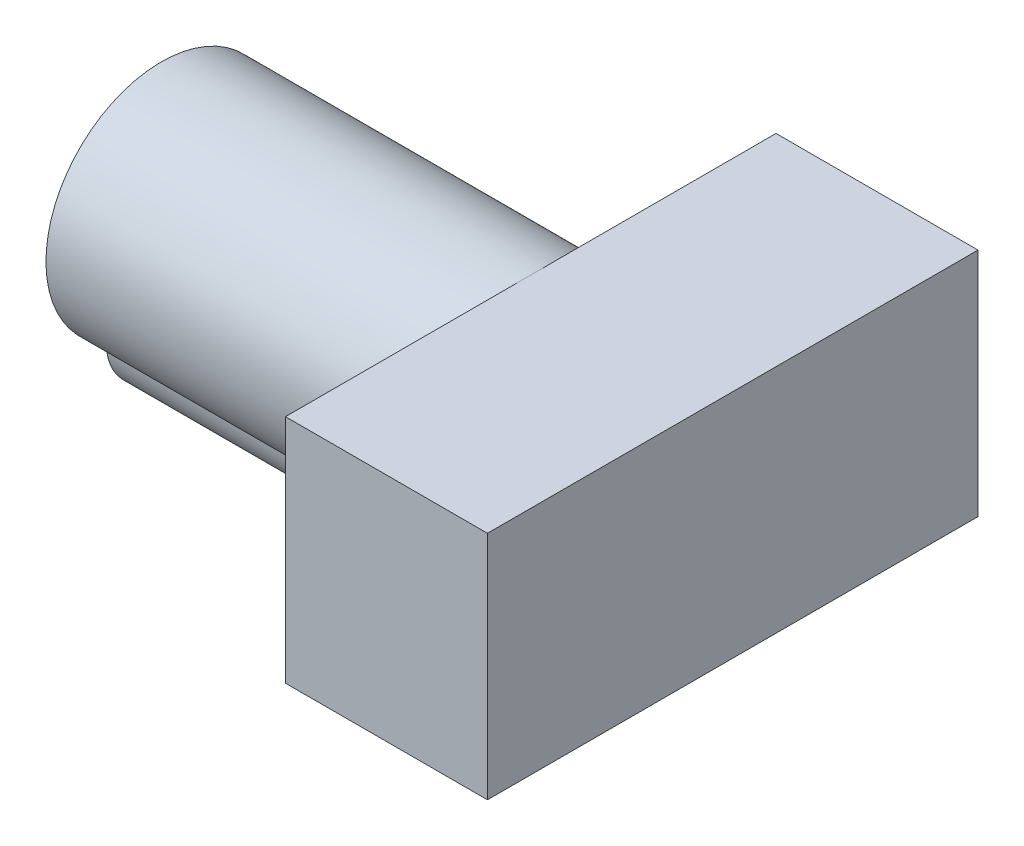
ISO-10303-21;
HEADER;
FILE_DESCRIPTION(('STEP AP214'),'2;1');
FILE_NAME('part.step','',(''),(''),'','','');
FILE_SCHEMA(('AUTOMOTIVE_DESIGN { 1 0 10303 214 1 1 1 1 }'));
ENDSEC;
DATA;
#1=APPLICATION_CONTEXT('core data for automotive mechanical design processes');
#2=APPLICATION_PROTOCOL_DEFINITION('international standard','automotive_design',2000,#1);
#3=PRODUCT_CONTEXT('',#1,'mechanical');
#4=PRODUCT('Part','Part','',(#3));
#5=PRODUCT_RELATED_PRODUCT_CATEGORY('part','',(#4));
#6=PRODUCT_DEFINITION_FORMATION('','',#4);
#7=PRODUCT_DEFINITION_CONTEXT('part definition',#1,'design');
#8=PRODUCT_DEFINITION('design','',#6,#7);
#9=PRODUCT_DEFINITION_SHAPE('','',#8);
#10=(LENGTH_UNIT() NAMED_UNIT(*) SI_UNIT(.MILLI.,.METRE.));
#11=(NAMED_UNIT(*) PLANE_ANGLE_UNIT() SI_UNIT($,.RADIAN.));
#12=(NAMED_UNIT(*) SI_UNIT($,.STERADIAN.) SOLID_ANGLE_UNIT());
#13=UNCERTAINTY_MEASURE_WITH_UNIT(LENGTH_MEASURE(1.E-05),#10,'distance_accuracy_value','');
#14=(GEOMETRIC_REPRESENTATION_CONTEXT(3) GLOBAL_UNCERTAINTY_ASSIGNED_CONTEXT((#13)) GLOBAL_UNIT_ASSIGNED_CONTEXT((#10,
#11,#12)) REPRESENTATION_CONTEXT('',''));
#15=CARTESIAN_POINT('',(0.,0.,0.));
#16=DIRECTION('',(0.,0.,1.));
#17=DIRECTION('',(1.,0.,0.));
#18=AXIS2_PLACEMENT_3D('',#15,#16,#17);
#19=CARTESIAN_POINT('',(-81.28,25.4,-53.975));
#20=DIRECTION('',(-1.,0.,0.));
#21=DIRECTION('',(0.,0.,1.));
#22=AXIS2_PLACEMENT_3D('',#19,#20,#21);
#23=PLANE('',#22);
#24=DIRECTION('',(0.,-1.,0.));
#25=VECTOR('',#24,1.);
#26=CARTESIAN_POINT('',(-81.28,12.7,-67.2214926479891));
#27=LINE('',#26,#25);
#28=CARTESIAN_POINT('',(-81.28,3.72765742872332,-67.2214926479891));
#29=VERTEX_POINT('',#28);
#30=CARTESIAN_POINT('',(-81.28,3.09636220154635,-67.2214926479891));
#31=VERTEX_POINT('',#30);
#32=EDGE_CURVE('E53',#29,#31,#27,.T.);
#33=ORIENTED_EDGE('',*,*,#32,.T.);
#34=CARTESIAN_POINT('',(-81.28,3.41200981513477,-54.5214926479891));
#35=DIRECTION('',(-1.,0.,0.));
#36=DIRECTION('',(0.,0.,1.));
#37=AXIS2_PLACEMENT_3D('',#34,#35,#36);
#38=CIRCLE('',#37,12.7039219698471);
#39=CARTESIAN_POINT('',(-81.28,3.09636220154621,-41.8214926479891));
#40=VERTEX_POINT('',#39);
#41=EDGE_CURVE('E94',#31,#40,#38,.T.);
#42=ORIENTED_EDGE('',*,*,#41,.T.);
#43=CARTESIAN_POINT('',(-81.28,25.4,-53.975));
#44=DIRECTION('',(-1.,0.,0.));
#45=DIRECTION('',(0.,0.,1.));
#46=AXIS2_PLACEMENT_3D('',#43,#44,#45);
#47=CIRCLE('',#46,25.4);
#48=EDGE_CURVE('E107',#40,#29,#47,.T.);
#49=ORIENTED_EDGE('',*,*,#48,.T.);
#50=EDGE_LOOP('',(#33,#42,#49));
#51=FACE_BOUND('',#50,.T.);
#52=ADVANCED_FACE('F32',(#51),#23,.T.);
#53=CARTESIAN_POINT('',(-81.28,12.7,-67.2214926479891));
#54=DIRECTION('',(0.,0.,-1.));
#55=DIRECTION('',(-1.,0.,0.));
#56=AXIS2_PLACEMENT_3D('',#53,#54,#55);
#57=PLANE('',#56);
#58=DIRECTION('',(0.,-1.,0.));
#59=VECTOR('',#58,1.);
#60=CARTESIAN_POINT('',(-30.48,12.7,-67.2214926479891));
#61=LINE('',#60,#59);
#62=CARTESIAN_POINT('',(-30.48,3.72765742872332,-67.2214926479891));
#63=VERTEX_POINT('',#62);
#64=CARTESIAN_POINT('',(-30.48,3.09636220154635,-67.2214926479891));
#65=VERTEX_POINT('',#64);
#66=EDGE_CURVE('E105',#63,#65,#61,.T.);
#67=ORIENTED_EDGE('',*,*,#66,.T.);
#68=DIRECTION('',(-1.,0.,0.));
#69=VECTOR('',#68,1.);
#70=CARTESIAN_POINT('',(-25.4,3.09636220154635,-67.2214926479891));
#71=LINE('',#70,#69);
#72=EDGE_CURVE('E47',#65,#31,#71,.T.);
#73=ORIENTED_EDGE('',*,*,#72,.T.);
#74=ORIENTED_EDGE('',*,*,#32,.F.);
#75=DIRECTION('',(1.,0.,0.));
#76=VECTOR('',#75,1.);
#77=CARTESIAN_POINT('',(-81.28,3.72765742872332,-67.2214926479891));
#78=LINE('',#77,#76);
#79=EDGE_CURVE('E109',#63,#29,#78,.F.);
#80=ORIENTED_EDGE('',*,*,#79,.F.);
#81=EDGE_LOOP('',(#67,#73,#74,#80));
#82=FACE_BOUND('',#81,.T.);
#83=ADVANCED_FACE('F103',(#82),#57,.T.);
#84=CARTESIAN_POINT('',(-30.48,12.7,-67.2214926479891));
#85=DIRECTION('',(1.,0.,0.));
#86=DIRECTION('',(0.,0.,-1.));
#87=AXIS2_PLACEMENT_3D('',#84,#85,#86);
#88=PLANE('',#87);
#89=CARTESIAN_POINT('',(-30.48,25.4,-53.975));
#90=DIRECTION('',(1.,0.,0.));
#91=DIRECTION('',(0.,0.,-1.));
#92=AXIS2_PLACEMENT_3D('',#89,#90,#91);
#93=CIRCLE('',#92,25.4);
#94=CARTESIAN_POINT('',(-30.48,3.09636220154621,-41.8214926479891));
#95=VERTEX_POINT('',#94);
#96=EDGE_CURVE('E40',#95,#63,#93,.T.);
#97=ORIENTED_EDGE('',*,*,#96,.F.);
#98=CARTESIAN_POINT('',(-30.48,3.41200981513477,-54.5214926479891));
#99=DIRECTION('',(1.,0.,0.));
#100=DIRECTION('',(0.,0.,-1.));
#101=AXIS2_PLACEMENT_3D('',#98,#99,#100);
#102=CIRCLE('',#101,12.7039219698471);
#103=EDGE_CURVE('E11',#95,#65,#102,.T.);
#104=ORIENTED_EDGE('',*,*,#103,.T.);
#105=ORIENTED_EDGE('',*,*,#66,.F.);
#106=EDGE_LOOP('',(#97,#104,#105));
#107=FACE_BOUND('',#106,.T.);
#108=ADVANCED_FACE('F197',(#107),#88,.T.);
#109=CARTESIAN_POINT('',(0.,50.8,0.));
#110=DIRECTION('',(1.,0.,0.));
#111=DIRECTION('',(0.,0.,-1.));
#112=AXIS2_PLACEMENT_3D('',#109,#110,#111);
#113=PLANE('',#112);
#114=CARTESIAN_POINT('',(0.,25.4,-53.975));
#115=DIRECTION('',(-1.,0.,0.));
#116=DIRECTION('',(0.,0.,1.));
#117=AXIS2_PLACEMENT_3D('',#114,#115,#116);
#118=CIRCLE('',#117,25.4);
#119=CARTESIAN_POINT('',(0.,50.8,-53.975));
#120=VERTEX_POINT('',#119);
#121=CARTESIAN_POINT('',(0.,0.,-53.975));
#122=VERTEX_POINT('',#121);
#123=EDGE_CURVE('E114',#120,#122,#118,.T.);
#124=ORIENTED_EDGE('',*,*,#123,.F.);
#125=DIRECTION('',(0.,0.,1.));
#126=VECTOR('',#125,1.);
#127=CARTESIAN_POINT('',(0.,50.8,0.));
#128=LINE('',#127,#126);
#129=CARTESIAN_POINT('',(0.,50.8,-107.95));
#130=VERTEX_POINT('',#129);
#131=EDGE_CURVE('E120',#130,#120,#128,.T.);
#132=ORIENTED_EDGE('',*,*,#131,.F.);
#133=DIRECTION('',(0.,-1.,0.));
#134=VECTOR('',#133,1.);
#135=CARTESIAN_POINT('',(0.,50.8,-107.95));
#136=LINE('',#135,#134);
#137=CARTESIAN_POINT('',(0.,0.,-107.95));
#138=VERTEX_POINT('',#137);
#139=EDGE_CURVE('E129',#130,#138,#136,.T.);
#140=ORIENTED_EDGE('',*,*,#139,.T.);
#141=DIRECTION('',(0.,0.,1.));
#142=VECTOR('',#141,1.);
#143=CARTESIAN_POINT('',(0.,0.,0.));
#144=LINE('',#143,#142);
#145=EDGE_CURVE('E130',#138,#122,#144,.T.);
#146=ORIENTED_EDGE('',*,*,#145,.T.);
#147=EDGE_LOOP('',(#124,#132,#140,#146));
#148=FACE_BOUND('',#147,.T.);
#149=ADVANCED_FACE('F167',(#148),#113,.F.);
#150=EDGE_CURVE('E119',#122,#120,#118,.T.);
#151=ORIENTED_EDGE('',*,*,#150,.F.);
#152=CARTESIAN_POINT('',(0.,0.,0.));
#153=VERTEX_POINT('',#152);
#154=EDGE_CURVE('E116',#122,#153,#144,.T.);
#155=ORIENTED_EDGE('',*,*,#154,.T.);
#156=DIRECTION('',(0.,-1.,0.));
#157=VECTOR('',#156,1.);
#158=CARTESIAN_POINT('',(0.,50.8,0.));
#159=LINE('',#158,#157);
#160=CARTESIAN_POINT('',(0.,50.8,0.));
#161=VERTEX_POINT('',#160);
#162=EDGE_CURVE('E147',#161,#153,#159,.T.);
#163=ORIENTED_EDGE('',*,*,#162,.F.);
#164=EDGE_CURVE('E123',#120,#161,#128,.T.);
#165=ORIENTED_EDGE('',*,*,#164,.F.);
#166=EDGE_LOOP('',(#151,#155,#163,#165));
#167=FACE_BOUND('',#166,.T.);
#168=ADVANCED_FACE('F34',(#167),#113,.F.);
#169=CARTESIAN_POINT('',(0.,50.8,0.));
#170=DIRECTION('',(0.,0.,-1.));
#171=DIRECTION('',(-1.,0.,0.));
#172=AXIS2_PLACEMENT_3D('',#169,#170,#171);
#173=PLANE('',#172);
#174=DIRECTION('',(1.,0.,0.));
#175=VECTOR('',#174,1.);
#176=CARTESIAN_POINT('',(0.,0.,0.));
#177=LINE('',#176,#175);
#178=CARTESIAN_POINT('',(44.45,0.,0.));
#179=VERTEX_POINT('',#178);
#180=EDGE_CURVE('E133',#153,#179,#177,.T.);
#181=ORIENTED_EDGE('',*,*,#180,.T.);
#182=DIRECTION('',(0.,-1.,0.));
#183=VECTOR('',#182,1.);
#184=CARTESIAN_POINT('',(44.45,50.8,0.));
#185=LINE('',#184,#183);
#186=CARTESIAN_POINT('',(44.45,50.8,0.));
#187=VERTEX_POINT('',#186);
#188=EDGE_CURVE('E144',#187,#179,#185,.T.);
#189=ORIENTED_EDGE('',*,*,#188,.F.);
#190=DIRECTION('',(1.,0.,0.));
#191=VECTOR('',#190,1.);
#192=CARTESIAN_POINT('',(0.,50.8,0.));
#193=LINE('',#192,#191);
#194=EDGE_CURVE('E122',#161,#187,#193,.T.);
#195=ORIENTED_EDGE('',*,*,#194,.F.);
#196=ORIENTED_EDGE('',*,*,#162,.T.);
#197=EDGE_LOOP('',(#181,#189,#195,#196));
#198=FACE_BOUND('',#197,.T.);
#199=ADVANCED_FACE('F180',(#198),#173,.F.);
#200=CARTESIAN_POINT('',(44.45,50.8,0.));
#201=DIRECTION('',(-1.,0.,0.));
#202=DIRECTION('',(0.,0.,1.));
#203=AXIS2_PLACEMENT_3D('',#200,#201,#202);
#204=PLANE('',#203);
#205=DIRECTION('',(0.,0.,-1.));
#206=VECTOR('',#205,1.);
#207=CARTESIAN_POINT('',(44.45,0.,0.));
#208=LINE('',#207,#206);
#209=CARTESIAN_POINT('',(44.45,0.,-107.95));
#210=VERTEX_POINT('',#209);
#211=EDGE_CURVE('E135',#179,#210,#208,.T.);
#212=ORIENTED_EDGE('',*,*,#211,.T.);
#213=DIRECTION('',(0.,-1.,0.));
#214=VECTOR('',#213,1.);
#215=CARTESIAN_POINT('',(44.45,50.8,-107.95));
#216=LINE('',#215,#214);
#217=CARTESIAN_POINT('',(44.45,50.8,-107.95));
#218=VERTEX_POINT('',#217);
#219=EDGE_CURVE('E141',#218,#210,#216,.T.);
#220=ORIENTED_EDGE('',*,*,#219,.F.);
#221=DIRECTION('',(0.,0.,-1.));
#222=VECTOR('',#221,1.);
#223=CARTESIAN_POINT('',(44.45,50.8,0.));
#224=LINE('',#223,#222);
#225=EDGE_CURVE('E125',#187,#218,#224,.T.);
#226=ORIENTED_EDGE('',*,*,#225,.F.);
#227=ORIENTED_EDGE('',*,*,#188,.T.);
#228=EDGE_LOOP('',(#212,#220,#226,#227));
#229=FACE_BOUND('',#228,.T.);
#230=ADVANCED_FACE('F175',(#229),#204,.F.);
#231=CARTESIAN_POINT('',(0.,50.8,-107.95));
#232=DIRECTION('',(0.,0.,1.));
#233=DIRECTION('',(1.,0.,0.));
#234=AXIS2_PLACEMENT_3D('',#231,#232,#233);
#235=PLANE('',#234);
#236=DIRECTION('',(-1.,0.,0.));
#237=VECTOR('',#236,1.);
#238=CARTESIAN_POINT('',(0.,0.,-107.95));
#239=LINE('',#238,#237);
#240=EDGE_CURVE('E137',#210,#138,#239,.T.);
#241=ORIENTED_EDGE('',*,*,#240,.T.);
#242=ORIENTED_EDGE('',*,*,#139,.F.);
#243=DIRECTION('',(-1.,0.,0.));
#244=VECTOR('',#243,1.);
#245=CARTESIAN_POINT('',(0.,50.8,-107.95));
#246=LINE('',#245,#244);
#247=EDGE_CURVE('E127',#218,#130,#246,.T.);
#248=ORIENTED_EDGE('',*,*,#247,.F.);
#249=ORIENTED_EDGE('',*,*,#219,.T.);
#250=EDGE_LOOP('',(#241,#242,#248,#249));
#251=FACE_BOUND('',#250,.T.);
#252=ADVANCED_FACE('F172',(#251),#235,.F.);
#253=CARTESIAN_POINT('',(0.,50.8,0.));
#254=DIRECTION('',(0.,-1.,0.));
#255=DIRECTION('',(0.,0.,-1.));
#256=AXIS2_PLACEMENT_3D('',#253,#254,#255);
#257=PLANE('',#256);
#258=ORIENTED_EDGE('',*,*,#131,.T.);
#259=ORIENTED_EDGE('',*,*,#164,.T.);
#260=ORIENTED_EDGE('',*,*,#194,.T.);
#261=ORIENTED_EDGE('',*,*,#225,.T.);
#262=ORIENTED_EDGE('',*,*,#247,.T.);
#263=EDGE_LOOP('',(#258,#259,#260,#261,#262));
#264=FACE_BOUND('',#263,.T.);
#265=ADVANCED_FACE('F182',(#264),#257,.F.);
#266=CARTESIAN_POINT('',(0.,0.,0.));
#267=DIRECTION('',(0.,-1.,0.));
#268=DIRECTION('',(0.,0.,-1.));
#269=AXIS2_PLACEMENT_3D('',#266,#267,#268);
#270=PLANE('',#269);
#271=ORIENTED_EDGE('',*,*,#145,.F.);
#272=ORIENTED_EDGE('',*,*,#240,.F.);
#273=ORIENTED_EDGE('',*,*,#211,.F.);
#274=ORIENTED_EDGE('',*,*,#180,.F.);
#275=ORIENTED_EDGE('',*,*,#154,.F.);
#276=EDGE_LOOP('',(#271,#272,#273,#274,#275));
#277=FACE_BOUND('',#276,.T.);
#278=ADVANCED_FACE('F163',(#277),#270,.T.);
#279=CARTESIAN_POINT('',(-81.28,25.4,-53.975));
#280=DIRECTION('',(1.,0.,0.));
#281=DIRECTION('',(0.,0.,-1.));
#282=AXIS2_PLACEMENT_3D('',#279,#280,#281);
#283=CYLINDRICAL_SURFACE('',#282,25.4);
#284=ORIENTED_EDGE('',*,*,#48,.F.);
#285=DIRECTION('',(1.,0.,0.));
#286=VECTOR('',#285,1.);
#287=CARTESIAN_POINT('',(-81.28,3.09636220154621,-41.8214926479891));
#288=LINE('',#287,#286);
#289=EDGE_CURVE('E97',#40,#95,#288,.T.);
#290=ORIENTED_EDGE('',*,*,#289,.T.);
#291=ORIENTED_EDGE('',*,*,#96,.T.);
#292=ORIENTED_EDGE('',*,*,#79,.T.);
#293=EDGE_LOOP('',(#284,#290,#291,#292));
#294=FACE_BOUND('',#293,.T.);
#295=ORIENTED_EDGE('',*,*,#123,.T.);
#296=ORIENTED_EDGE('',*,*,#150,.T.);
#297=EDGE_LOOP('',(#295,#296));
#298=FACE_BOUND('',#297,.T.);
#299=ADVANCED_FACE('F154',(#294,#298),#283,.T.);
#300=CARTESIAN_POINT('',(-25.4,3.41200981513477,-54.5214926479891));
#301=DIRECTION('',(-1.,0.,0.));
#302=DIRECTION('',(0.,0.,1.));
#303=AXIS2_PLACEMENT_3D('',#300,#301,#302);
#304=CYLINDRICAL_SURFACE('',#303,12.7039219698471);
#305=ORIENTED_EDGE('',*,*,#289,.F.);
#306=ORIENTED_EDGE('',*,*,#41,.F.);
#307=ORIENTED_EDGE('',*,*,#72,.F.);
#308=ORIENTED_EDGE('',*,*,#103,.F.);
#309=EDGE_LOOP('',(#305,#306,#307,#308));
#310=FACE_BOUND('',#309,.T.);
#311=ADVANCED_FACE('F95',(#310),#304,.T.);
#312=CLOSED_SHELL('',(#52,#83,#108,#149,#168,#199,#230,#252,#265,#278,#299,#311));
#313=MANIFOLD_SOLID_BREP('B2',#312);
#314=ADVANCED_BREP_SHAPE_REPRESENTATION('',(#18,#313),#14);
#315=SHAPE_DEFINITION_REPRESENTATION(#9,#314);
ENDSEC;
END-ISO-10303-21;
